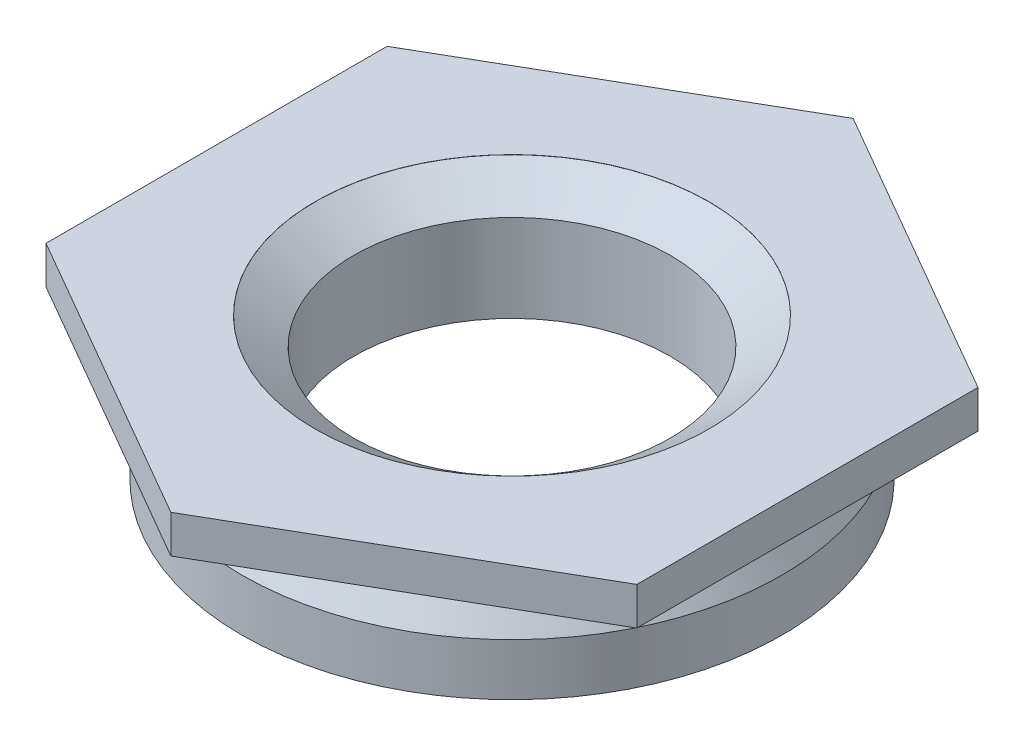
ISO-10303-21;
HEADER;
FILE_DESCRIPTION(('STEP AP214'),'2;1');
FILE_NAME('part.step','',(''),(''),'','','');
FILE_SCHEMA(('AUTOMOTIVE_DESIGN { 1 0 10303 214 1 1 1 1 }'));
ENDSEC;
DATA;
#1=APPLICATION_CONTEXT('core data for automotive mechanical design processes');
#2=APPLICATION_PROTOCOL_DEFINITION('international standard','automotive_design',2000,#1);
#3=PRODUCT_CONTEXT('',#1,'mechanical');
#4=PRODUCT('Part','Part','',(#3));
#5=PRODUCT_RELATED_PRODUCT_CATEGORY('part','',(#4));
#6=PRODUCT_DEFINITION_FORMATION('','',#4);
#7=PRODUCT_DEFINITION_CONTEXT('part definition',#1,'design');
#8=PRODUCT_DEFINITION('design','',#6,#7);
#9=PRODUCT_DEFINITION_SHAPE('','',#8);
#10=(LENGTH_UNIT() NAMED_UNIT(*) SI_UNIT(.MILLI.,.METRE.));
#11=(NAMED_UNIT(*) PLANE_ANGLE_UNIT() SI_UNIT($,.RADIAN.));
#12=(NAMED_UNIT(*) SI_UNIT($,.STERADIAN.) SOLID_ANGLE_UNIT());
#13=UNCERTAINTY_MEASURE_WITH_UNIT(LENGTH_MEASURE(1.E-05),#10,'distance_accuracy_value','');
#14=(GEOMETRIC_REPRESENTATION_CONTEXT(3) GLOBAL_UNCERTAINTY_ASSIGNED_CONTEXT((#13)) GLOBAL_UNIT_ASSIGNED_CONTEXT((#10,
#11,#12)) REPRESENTATION_CONTEXT('',''));
#15=CARTESIAN_POINT('',(0.,0.,0.));
#16=DIRECTION('',(0.,0.,1.));
#17=DIRECTION('',(1.,0.,0.));
#18=AXIS2_PLACEMENT_3D('',#15,#16,#17);
#19=CARTESIAN_POINT('',(4.04814136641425,0.,0.));
#20=DIRECTION('',(0.,-1.,0.));
#21=DIRECTION('',(0.,0.,-1.));
#22=AXIS2_PLACEMENT_3D('',#19,#20,#21);
#23=PLANE('',#22);
#24=CARTESIAN_POINT('',(0.,0.,0.));
#25=DIRECTION('',(0.,-1.,0.));
#26=DIRECTION('',(0.,0.,-1.));
#27=AXIS2_PLACEMENT_3D('',#24,#25,#26);
#28=CIRCLE('',#27,4.04814136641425);
#29=CARTESIAN_POINT('',(0.,0.,-4.04814136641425));
#30=VERTEX_POINT('',#29);
#31=EDGE_CURVE('E11',#30,#30,#28,.T.);
#32=ORIENTED_EDGE('',*,*,#31,.F.);
#33=EDGE_LOOP('',(#32));
#34=FACE_BOUND('',#33,.T.);
#35=DIRECTION('',(0.,0.,-1.));
#36=VECTOR('',#35,1.);
#37=CARTESIAN_POINT('',(4.7625,0.,-2.74963065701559));
#38=LINE('',#37,#36);
#39=CARTESIAN_POINT('',(4.7625,0.,2.74963065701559));
#40=VERTEX_POINT('',#39);
#41=CARTESIAN_POINT('',(4.7625,0.,-2.74963065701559));
#42=VERTEX_POINT('',#41);
#43=EDGE_CURVE('E109',#40,#42,#38,.T.);
#44=ORIENTED_EDGE('',*,*,#43,.F.);
#45=DIRECTION('',(0.866025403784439,0.,-0.5));
#46=VECTOR('',#45,1.);
#47=CARTESIAN_POINT('',(4.7625,0.,2.74963065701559));
#48=LINE('',#47,#46);
#49=CARTESIAN_POINT('',(0.,0.,5.49926131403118));
#50=VERTEX_POINT('',#49);
#51=EDGE_CURVE('E54',#50,#40,#48,.T.);
#52=ORIENTED_EDGE('',*,*,#51,.F.);
#53=DIRECTION('',(0.866025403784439,0.,0.5));
#54=VECTOR('',#53,1.);
#55=CARTESIAN_POINT('',(0.,0.,5.49926131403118));
#56=LINE('',#55,#54);
#57=CARTESIAN_POINT('',(-4.7625,0.,2.74963065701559));
#58=VERTEX_POINT('',#57);
#59=EDGE_CURVE('E116',#58,#50,#56,.T.);
#60=ORIENTED_EDGE('',*,*,#59,.F.);
#61=DIRECTION('',(0.,0.,1.));
#62=VECTOR('',#61,1.);
#63=CARTESIAN_POINT('',(-4.7625,0.,2.74963065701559));
#64=LINE('',#63,#62);
#65=CARTESIAN_POINT('',(-4.7625,0.,-2.74963065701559));
#66=VERTEX_POINT('',#65);
#67=EDGE_CURVE('E112',#66,#58,#64,.T.);
#68=ORIENTED_EDGE('',*,*,#67,.F.);
#69=DIRECTION('',(-0.866025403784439,0.,0.5));
#70=VECTOR('',#69,1.);
#71=CARTESIAN_POINT('',(-4.7625,0.,-2.74963065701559));
#72=LINE('',#71,#70);
#73=CARTESIAN_POINT('',(0.,0.,-5.49926131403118));
#74=VERTEX_POINT('',#73);
#75=EDGE_CURVE('E97',#74,#66,#72,.T.);
#76=ORIENTED_EDGE('',*,*,#75,.F.);
#77=DIRECTION('',(-0.866025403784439,0.,-0.5));
#78=VECTOR('',#77,1.);
#79=CARTESIAN_POINT('',(0.,0.,-5.49926131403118));
#80=LINE('',#79,#78);
#81=EDGE_CURVE('E102',#42,#74,#80,.T.);
#82=ORIENTED_EDGE('',*,*,#81,.F.);
#83=EDGE_LOOP('',(#44,#52,#60,#68,#76,#82));
#84=FACE_BOUND('',#83,.T.);
#85=ADVANCED_FACE('F39',(#34,#84),#23,.T.);
#86=CARTESIAN_POINT('',(5.5118,0.6096,0.));
#87=DIRECTION('',(0.,1.,0.));
#88=DIRECTION('',(0.,0.,1.));
#89=AXIS2_PLACEMENT_3D('',#86,#87,#88);
#90=PLANE('',#89);
#91=CARTESIAN_POINT('',(0.,0.6096,0.));
#92=DIRECTION('',(0.,1.,0.));
#93=DIRECTION('',(0.,0.,1.));
#94=AXIS2_PLACEMENT_3D('',#91,#92,#93);
#95=CIRCLE('',#94,3.175);
#96=CARTESIAN_POINT('',(0.,0.6096,3.175));
#97=VERTEX_POINT('',#96);
#98=EDGE_CURVE('E45',#97,#97,#95,.T.);
#99=ORIENTED_EDGE('',*,*,#98,.F.);
#100=EDGE_LOOP('',(#99));
#101=FACE_BOUND('',#100,.T.);
#102=DIRECTION('',(0.866025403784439,0.,0.5));
#103=VECTOR('',#102,1.);
#104=CARTESIAN_POINT('',(0.,0.6096,5.49926131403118));
#105=LINE('',#104,#103);
#106=CARTESIAN_POINT('',(-4.7625,0.6096,2.74963065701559));
#107=VERTEX_POINT('',#106);
#108=CARTESIAN_POINT('',(0.,0.6096,5.49926131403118));
#109=VERTEX_POINT('',#108);
#110=EDGE_CURVE('E133',#107,#109,#105,.T.);
#111=ORIENTED_EDGE('',*,*,#110,.T.);
#112=DIRECTION('',(0.866025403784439,0.,-0.5));
#113=VECTOR('',#112,1.);
#114=CARTESIAN_POINT('',(4.7625,0.6096,2.74963065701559));
#115=LINE('',#114,#113);
#116=CARTESIAN_POINT('',(4.7625,0.6096,2.74963065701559));
#117=VERTEX_POINT('',#116);
#118=EDGE_CURVE('E124',#109,#117,#115,.T.);
#119=ORIENTED_EDGE('',*,*,#118,.T.);
#120=DIRECTION('',(0.,0.,-1.));
#121=VECTOR('',#120,1.);
#122=CARTESIAN_POINT('',(4.7625,0.6096,-2.74963065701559));
#123=LINE('',#122,#121);
#124=CARTESIAN_POINT('',(4.7625,0.6096,-2.74963065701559));
#125=VERTEX_POINT('',#124);
#126=EDGE_CURVE('E128',#117,#125,#123,.T.);
#127=ORIENTED_EDGE('',*,*,#126,.T.);
#128=DIRECTION('',(-0.866025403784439,0.,-0.5));
#129=VECTOR('',#128,1.);
#130=CARTESIAN_POINT('',(0.,0.6096,-5.49926131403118));
#131=LINE('',#130,#129);
#132=CARTESIAN_POINT('',(0.,0.6096,-5.49926131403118));
#133=VERTEX_POINT('',#132);
#134=EDGE_CURVE('E62',#125,#133,#131,.T.);
#135=ORIENTED_EDGE('',*,*,#134,.T.);
#136=DIRECTION('',(-0.866025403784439,0.,0.5));
#137=VECTOR('',#136,1.);
#138=CARTESIAN_POINT('',(-4.7625,0.6096,-2.74963065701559));
#139=LINE('',#138,#137);
#140=CARTESIAN_POINT('',(-4.7625,0.6096,-2.74963065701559));
#141=VERTEX_POINT('',#140);
#142=EDGE_CURVE('E99',#133,#141,#139,.T.);
#143=ORIENTED_EDGE('',*,*,#142,.T.);
#144=DIRECTION('',(0.,0.,1.));
#145=VECTOR('',#144,1.);
#146=CARTESIAN_POINT('',(-4.7625,0.6096,2.74963065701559));
#147=LINE('',#146,#145);
#148=EDGE_CURVE('E131',#141,#107,#147,.T.);
#149=ORIENTED_EDGE('',*,*,#148,.T.);
#150=EDGE_LOOP('',(#111,#119,#127,#135,#143,#149));
#151=FACE_BOUND('',#150,.T.);
#152=ADVANCED_FACE('F186',(#101,#151),#90,.T.);
#153=CARTESIAN_POINT('',(0.,0.,0.));
#154=DIRECTION('',(0.,-1.,0.));
#155=DIRECTION('',(0.,0.,-1.));
#156=AXIS2_PLACEMENT_3D('',#153,#154,#155);
#157=CYLINDRICAL_SURFACE('',#156,4.04814136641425);
#158=ORIENTED_EDGE('',*,*,#31,.T.);
#159=EDGE_LOOP('',(#158));
#160=FACE_BOUND('',#159,.T.);
#161=CARTESIAN_POINT('',(0.,-0.3048,0.));
#162=DIRECTION('',(0.,-1.,0.));
#163=DIRECTION('',(0.,0.,-1.));
#164=AXIS2_PLACEMENT_3D('',#161,#162,#163);
#165=CIRCLE('',#164,4.04814136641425);
#166=CARTESIAN_POINT('',(0.,-0.3048,-4.04814136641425));
#167=VERTEX_POINT('',#166);
#168=EDGE_CURVE('E50',#167,#167,#165,.T.);
#169=ORIENTED_EDGE('',*,*,#168,.F.);
#170=EDGE_LOOP('',(#169));
#171=FACE_BOUND('',#170,.T.);
#172=ADVANCED_FACE('F184',(#160,#171),#157,.T.);
#173=CARTESIAN_POINT('',(0.,-0.8382,0.));
#174=DIRECTION('',(0.,-1.,0.));
#175=DIRECTION('',(0.,0.,-1.));
#176=AXIS2_PLACEMENT_3D('',#173,#174,#175);
#177=CONICAL_SURFACE('',#176,4.3561,0.523598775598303);
#178=ORIENTED_EDGE('',*,*,#168,.T.);
#179=EDGE_LOOP('',(#178));
#180=FACE_BOUND('',#179,.T.);
#181=CARTESIAN_POINT('',(0.,-0.8382,0.));
#182=DIRECTION('',(0.,-1.,0.));
#183=DIRECTION('',(0.,0.,-1.));
#184=AXIS2_PLACEMENT_3D('',#181,#182,#183);
#185=CIRCLE('',#184,4.3561);
#186=CARTESIAN_POINT('',(0.,-0.8382,-4.3561));
#187=VERTEX_POINT('',#186);
#188=EDGE_CURVE('E160',#187,#187,#185,.T.);
#189=ORIENTED_EDGE('',*,*,#188,.F.);
#190=EDGE_LOOP('',(#189));
#191=FACE_BOUND('',#190,.T.);
#192=ADVANCED_FACE('F177',(#180,#191),#177,.T.);
#193=CARTESIAN_POINT('',(0.,0.,0.));
#194=DIRECTION('',(0.,-1.,0.));
#195=DIRECTION('',(0.,0.,-1.));
#196=AXIS2_PLACEMENT_3D('',#193,#194,#195);
#197=CYLINDRICAL_SURFACE('',#196,4.3561);
#198=ORIENTED_EDGE('',*,*,#188,.T.);
#199=EDGE_LOOP('',(#198));
#200=FACE_BOUND('',#199,.T.);
#201=CARTESIAN_POINT('',(0.,-1.6764,0.));
#202=DIRECTION('',(0.,-1.,0.));
#203=DIRECTION('',(0.,0.,-1.));
#204=AXIS2_PLACEMENT_3D('',#201,#202,#203);
#205=CIRCLE('',#204,4.3561);
#206=CARTESIAN_POINT('',(0.,-1.6764,-4.3561));
#207=VERTEX_POINT('',#206);
#208=EDGE_CURVE('E157',#207,#207,#205,.T.);
#209=ORIENTED_EDGE('',*,*,#208,.F.);
#210=EDGE_LOOP('',(#209));
#211=FACE_BOUND('',#210,.T.);
#212=ADVANCED_FACE('F172',(#200,#211),#197,.T.);
#213=CARTESIAN_POINT('',(2.5527,-1.6764,0.));
#214=DIRECTION('',(0.,-1.,0.));
#215=DIRECTION('',(0.,0.,-1.));
#216=AXIS2_PLACEMENT_3D('',#213,#214,#215);
#217=PLANE('',#216);
#218=CARTESIAN_POINT('',(0.,-1.6764,0.));
#219=DIRECTION('',(0.,-1.,0.));
#220=DIRECTION('',(0.,0.,-1.));
#221=AXIS2_PLACEMENT_3D('',#218,#219,#220);
#222=CIRCLE('',#221,3.175);
#223=CARTESIAN_POINT('',(0.,-1.6764,-3.175));
#224=VERTEX_POINT('',#223);
#225=EDGE_CURVE('E156',#224,#224,#222,.T.);
#226=ORIENTED_EDGE('',*,*,#225,.F.);
#227=EDGE_LOOP('',(#226));
#228=FACE_BOUND('',#227,.T.);
#229=ORIENTED_EDGE('',*,*,#208,.T.);
#230=EDGE_LOOP('',(#229));
#231=FACE_BOUND('',#230,.T.);
#232=ADVANCED_FACE('F167',(#228,#231),#217,.T.);
#233=CARTESIAN_POINT('',(0.,0.,0.));
#234=DIRECTION('',(0.,-1.,0.));
#235=DIRECTION('',(0.,0.,-1.));
#236=AXIS2_PLACEMENT_3D('',#233,#234,#235);
#237=CYLINDRICAL_SURFACE('',#236,2.5527);
#238=CARTESIAN_POINT('',(0.,0.17148269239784,0.));
#239=DIRECTION('',(0.,-1.,0.));
#240=DIRECTION('',(0.,0.,-1.));
#241=AXIS2_PLACEMENT_3D('',#238,#239,#240);
#242=CIRCLE('',#241,2.5527);
#243=CARTESIAN_POINT('',(0.,0.17148269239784,-2.5527));
#244=VERTEX_POINT('',#243);
#245=EDGE_CURVE('E149',#244,#244,#242,.T.);
#246=ORIENTED_EDGE('',*,*,#245,.F.);
#247=EDGE_LOOP('',(#246));
#248=FACE_BOUND('',#247,.T.);
#249=CARTESIAN_POINT('',(0.,-1.23828269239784,0.));
#250=DIRECTION('',(0.,-1.,0.));
#251=DIRECTION('',(0.,0.,-1.));
#252=AXIS2_PLACEMENT_3D('',#249,#250,#251);
#253=CIRCLE('',#252,2.5527);
#254=CARTESIAN_POINT('',(0.,-1.23828269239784,-2.5527));
#255=VERTEX_POINT('',#254);
#256=EDGE_CURVE('E152',#255,#255,#253,.T.);
#257=ORIENTED_EDGE('',*,*,#256,.T.);
#258=EDGE_LOOP('',(#257));
#259=FACE_BOUND('',#258,.T.);
#260=ADVANCED_FACE('F173',(#248,#259),#237,.F.);
#261=CARTESIAN_POINT('',(0.,-1.67386,0.));
#262=DIRECTION('',(0.,-1.,0.));
#263=DIRECTION('',(0.,0.,-1.));
#264=AXIS2_PLACEMENT_3D('',#261,#262,#263);
#265=CONICAL_SURFACE('',#264,3.175,0.960105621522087);
#266=ORIENTED_EDGE('',*,*,#256,.F.);
#267=EDGE_LOOP('',(#266));
#268=FACE_BOUND('',#267,.T.);
#269=CARTESIAN_POINT('',(0.,-1.67386,0.));
#270=DIRECTION('',(0.,-1.,0.));
#271=DIRECTION('',(0.,0.,-1.));
#272=AXIS2_PLACEMENT_3D('',#269,#270,#271);
#273=CIRCLE('',#272,3.175);
#274=CARTESIAN_POINT('',(0.,-1.67386,-3.175));
#275=VERTEX_POINT('',#274);
#276=EDGE_CURVE('E146',#275,#275,#273,.T.);
#277=ORIENTED_EDGE('',*,*,#276,.T.);
#278=EDGE_LOOP('',(#277));
#279=FACE_BOUND('',#278,.T.);
#280=ADVANCED_FACE('F233',(#268,#279),#265,.F.);
#281=CARTESIAN_POINT('',(0.,-2.54,0.));
#282=DIRECTION('',(0.,-1.,0.));
#283=DIRECTION('',(0.,0.,-1.));
#284=AXIS2_PLACEMENT_3D('',#281,#282,#283);
#285=CYLINDRICAL_SURFACE('',#284,3.175);
#286=ORIENTED_EDGE('',*,*,#225,.T.);
#287=EDGE_LOOP('',(#286));
#288=FACE_BOUND('',#287,.T.);
#289=ORIENTED_EDGE('',*,*,#276,.F.);
#290=EDGE_LOOP('',(#289));
#291=FACE_BOUND('',#290,.T.);
#292=ADVANCED_FACE('F170',(#288,#291),#285,.F.);
#293=CARTESIAN_POINT('',(0.,-2.54,0.));
#294=DIRECTION('',(0.,-1.,0.));
#295=DIRECTION('',(0.,0.,-1.));
#296=AXIS2_PLACEMENT_3D('',#293,#294,#295);
#297=CYLINDRICAL_SURFACE('',#296,3.175);
#298=ORIENTED_EDGE('',*,*,#98,.T.);
#299=EDGE_LOOP('',(#298));
#300=FACE_BOUND('',#299,.T.);
#301=CARTESIAN_POINT('',(0.,0.607059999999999,0.));
#302=DIRECTION('',(0.,-1.,0.));
#303=DIRECTION('',(0.,0.,-1.));
#304=AXIS2_PLACEMENT_3D('',#301,#302,#303);
#305=CIRCLE('',#304,3.175);
#306=CARTESIAN_POINT('',(0.,0.607059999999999,-3.175));
#307=VERTEX_POINT('',#306);
#308=EDGE_CURVE('E138',#307,#307,#305,.T.);
#309=ORIENTED_EDGE('',*,*,#308,.T.);
#310=EDGE_LOOP('',(#309));
#311=FACE_BOUND('',#310,.T.);
#312=ADVANCED_FACE('F249',(#300,#311),#297,.F.);
#313=CARTESIAN_POINT('',(0.,0.17148269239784,0.));
#314=DIRECTION('',(0.,1.,0.));
#315=DIRECTION('',(0.,0.,1.));
#316=AXIS2_PLACEMENT_3D('',#313,#314,#315);
#317=CONICAL_SURFACE('',#316,2.5527,0.960105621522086);
#318=ORIENTED_EDGE('',*,*,#308,.F.);
#319=EDGE_LOOP('',(#318));
#320=FACE_BOUND('',#319,.T.);
#321=ORIENTED_EDGE('',*,*,#245,.T.);
#322=EDGE_LOOP('',(#321));
#323=FACE_BOUND('',#322,.T.);
#324=ADVANCED_FACE('F260',(#320,#323),#317,.F.);
#325=CARTESIAN_POINT('',(4.7625,0.,2.74963065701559));
#326=DIRECTION('',(0.5,0.,0.866025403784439));
#327=DIRECTION('',(0.866025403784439,0.,-0.5));
#328=AXIS2_PLACEMENT_3D('',#325,#326,#327);
#329=PLANE('',#328);
#330=ORIENTED_EDGE('',*,*,#118,.F.);
#331=DIRECTION('',(0.,1.,0.));
#332=VECTOR('',#331,1.);
#333=CARTESIAN_POINT('',(0.,0.,5.49926131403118));
#334=LINE('',#333,#332);
#335=EDGE_CURVE('E137',#50,#109,#334,.T.);
#336=ORIENTED_EDGE('',*,*,#335,.F.);
#337=ORIENTED_EDGE('',*,*,#51,.T.);
#338=DIRECTION('',(0.,1.,0.));
#339=VECTOR('',#338,1.);
#340=CARTESIAN_POINT('',(4.7625,0.,2.74963065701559));
#341=LINE('',#340,#339);
#342=EDGE_CURVE('E125',#40,#117,#341,.T.);
#343=ORIENTED_EDGE('',*,*,#342,.T.);
#344=EDGE_LOOP('',(#330,#336,#337,#343));
#345=FACE_BOUND('',#344,.T.);
#346=ADVANCED_FACE('F269',(#345),#329,.T.);
#347=CARTESIAN_POINT('',(0.,0.,5.49926131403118));
#348=DIRECTION('',(-0.5,0.,0.866025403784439));
#349=DIRECTION('',(0.866025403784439,0.,0.5));
#350=AXIS2_PLACEMENT_3D('',#347,#348,#349);
#351=PLANE('',#350);
#352=ORIENTED_EDGE('',*,*,#110,.F.);
#353=DIRECTION('',(0.,1.,0.));
#354=VECTOR('',#353,1.);
#355=CARTESIAN_POINT('',(-4.7625,0.,2.74963065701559));
#356=LINE('',#355,#354);
#357=EDGE_CURVE('E140',#58,#107,#356,.T.);
#358=ORIENTED_EDGE('',*,*,#357,.F.);
#359=ORIENTED_EDGE('',*,*,#59,.T.);
#360=ORIENTED_EDGE('',*,*,#335,.T.);
#361=EDGE_LOOP('',(#352,#358,#359,#360));
#362=FACE_BOUND('',#361,.T.);
#363=ADVANCED_FACE('F287',(#362),#351,.T.);
#364=CARTESIAN_POINT('',(-4.7625,0.,2.74963065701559));
#365=DIRECTION('',(-1.,0.,0.));
#366=DIRECTION('',(0.,0.,1.));
#367=AXIS2_PLACEMENT_3D('',#364,#365,#366);
#368=PLANE('',#367);
#369=ORIENTED_EDGE('',*,*,#148,.F.);
#370=DIRECTION('',(0.,1.,0.));
#371=VECTOR('',#370,1.);
#372=CARTESIAN_POINT('',(-4.7625,0.,-2.74963065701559));
#373=LINE('',#372,#371);
#374=EDGE_CURVE('E103',#66,#141,#373,.T.);
#375=ORIENTED_EDGE('',*,*,#374,.F.);
#376=ORIENTED_EDGE('',*,*,#67,.T.);
#377=ORIENTED_EDGE('',*,*,#357,.T.);
#378=EDGE_LOOP('',(#369,#375,#376,#377));
#379=FACE_BOUND('',#378,.T.);
#380=ADVANCED_FACE('F298',(#379),#368,.T.);
#381=CARTESIAN_POINT('',(-4.7625,0.,-2.74963065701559));
#382=DIRECTION('',(-0.5,0.,-0.866025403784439));
#383=DIRECTION('',(-0.866025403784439,0.,0.5));
#384=AXIS2_PLACEMENT_3D('',#381,#382,#383);
#385=PLANE('',#384);
#386=ORIENTED_EDGE('',*,*,#142,.F.);
#387=DIRECTION('',(0.,1.,0.));
#388=VECTOR('',#387,1.);
#389=CARTESIAN_POINT('',(0.,0.,-5.49926131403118));
#390=LINE('',#389,#388);
#391=EDGE_CURVE('E94',#74,#133,#390,.T.);
#392=ORIENTED_EDGE('',*,*,#391,.F.);
#393=ORIENTED_EDGE('',*,*,#75,.T.);
#394=ORIENTED_EDGE('',*,*,#374,.T.);
#395=EDGE_LOOP('',(#386,#392,#393,#394));
#396=FACE_BOUND('',#395,.T.);
#397=ADVANCED_FACE('F95',(#396),#385,.T.);
#398=CARTESIAN_POINT('',(0.,0.,-5.49926131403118));
#399=DIRECTION('',(0.5,0.,-0.866025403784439));
#400=DIRECTION('',(-0.866025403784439,0.,-0.5));
#401=AXIS2_PLACEMENT_3D('',#398,#399,#400);
#402=PLANE('',#401);
#403=ORIENTED_EDGE('',*,*,#134,.F.);
#404=DIRECTION('',(0.,1.,0.));
#405=VECTOR('',#404,1.);
#406=CARTESIAN_POINT('',(4.7625,0.,-2.74963065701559));
#407=LINE('',#406,#405);
#408=EDGE_CURVE('E105',#42,#125,#407,.T.);
#409=ORIENTED_EDGE('',*,*,#408,.F.);
#410=ORIENTED_EDGE('',*,*,#81,.T.);
#411=ORIENTED_EDGE('',*,*,#391,.T.);
#412=EDGE_LOOP('',(#403,#409,#410,#411));
#413=FACE_BOUND('',#412,.T.);
#414=ADVANCED_FACE('F106',(#413),#402,.T.);
#415=CARTESIAN_POINT('',(4.7625,0.,-2.74963065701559));
#416=DIRECTION('',(1.,0.,0.));
#417=DIRECTION('',(0.,0.,-1.));
#418=AXIS2_PLACEMENT_3D('',#415,#416,#417);
#419=PLANE('',#418);
#420=ORIENTED_EDGE('',*,*,#126,.F.);
#421=ORIENTED_EDGE('',*,*,#342,.F.);
#422=ORIENTED_EDGE('',*,*,#43,.T.);
#423=ORIENTED_EDGE('',*,*,#408,.T.);
#424=EDGE_LOOP('',(#420,#421,#422,#423));
#425=FACE_BOUND('',#424,.T.);
#426=ADVANCED_FACE('F322',(#425),#419,.T.);
#427=CLOSED_SHELL('',(#85,#152,#172,#192,#212,#232,#260,#280,#292,#312,#324,#346,#363,#380,#397,
#414,#426));
#428=MANIFOLD_SOLID_BREP('B2',#427);
#429=ADVANCED_BREP_SHAPE_REPRESENTATION('',(#18,#428),#14);
#430=SHAPE_DEFINITION_REPRESENTATION(#9,#429);
ENDSEC;
END-ISO-10303-21;
